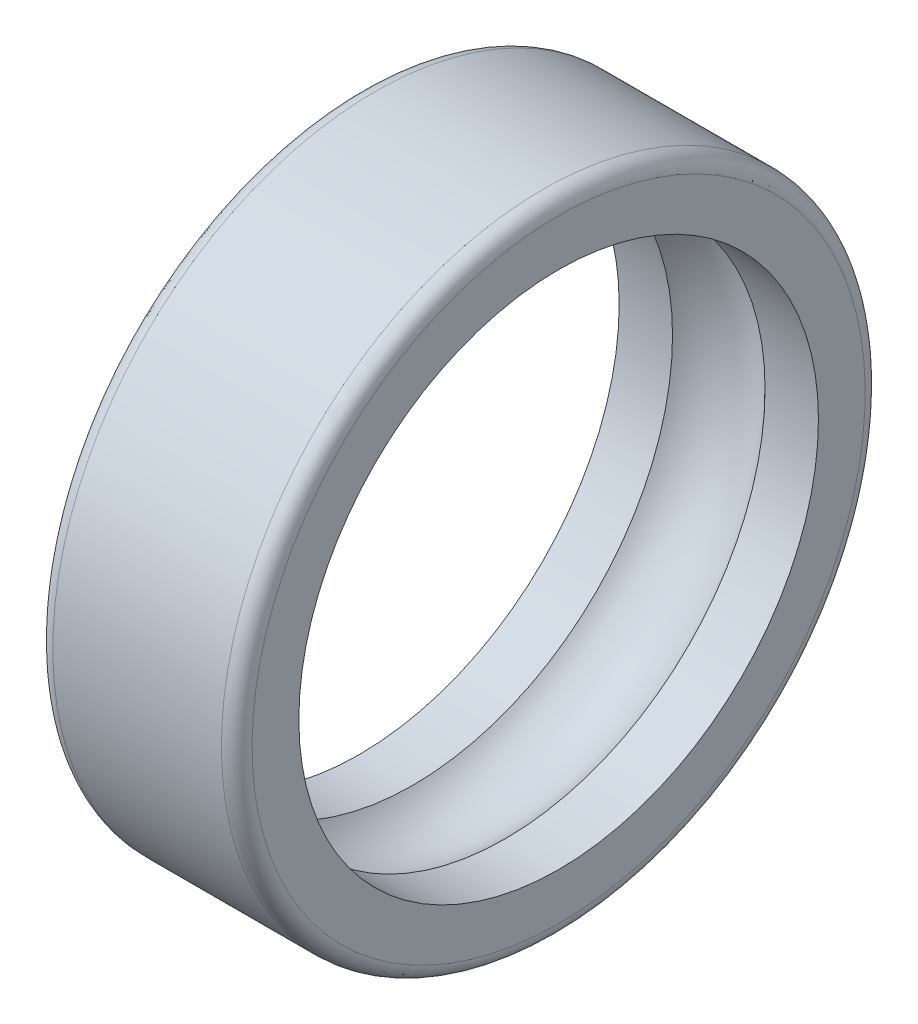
ISO-10303-21;
HEADER;
FILE_DESCRIPTION(('STEP AP214'),'2;1');
FILE_NAME('part.step','',(''),(''),'','','');
FILE_SCHEMA(('AUTOMOTIVE_DESIGN { 1 0 10303 214 1 1 1 1 }'));
ENDSEC;
DATA;
#1=APPLICATION_CONTEXT('core data for automotive mechanical design processes');
#2=APPLICATION_PROTOCOL_DEFINITION('international standard','automotive_design',2000,#1);
#3=PRODUCT_CONTEXT('',#1,'mechanical');
#4=PRODUCT('Part','Part','',(#3));
#5=PRODUCT_RELATED_PRODUCT_CATEGORY('part','',(#4));
#6=PRODUCT_DEFINITION_FORMATION('','',#4);
#7=PRODUCT_DEFINITION_CONTEXT('part definition',#1,'design');
#8=PRODUCT_DEFINITION('design','',#6,#7);
#9=PRODUCT_DEFINITION_SHAPE('','',#8);
#10=(LENGTH_UNIT() NAMED_UNIT(*) SI_UNIT(.MILLI.,.METRE.));
#11=(NAMED_UNIT(*) PLANE_ANGLE_UNIT() SI_UNIT($,.RADIAN.));
#12=(NAMED_UNIT(*) SI_UNIT($,.STERADIAN.) SOLID_ANGLE_UNIT());
#13=UNCERTAINTY_MEASURE_WITH_UNIT(LENGTH_MEASURE(1.E-05),#10,'distance_accuracy_value','');
#14=(GEOMETRIC_REPRESENTATION_CONTEXT(3) GLOBAL_UNCERTAINTY_ASSIGNED_CONTEXT((#13)) GLOBAL_UNIT_ASSIGNED_CONTEXT((#10,
#11,#12)) REPRESENTATION_CONTEXT('',''));
#15=CARTESIAN_POINT('',(0.,0.,0.));
#16=DIRECTION('',(0.,0.,1.));
#17=DIRECTION('',(1.,0.,0.));
#18=AXIS2_PLACEMENT_3D('',#15,#16,#17);
#19=CARTESIAN_POINT('',(1.,0.,0.));
#20=DIRECTION('',(-1.,0.,0.));
#21=DIRECTION('',(0.,-1.,0.));
#22=AXIS2_PLACEMENT_3D('',#19,#20,#21);
#23=TOROIDAL_SURFACE('',#22,20.,1.);
#24=CARTESIAN_POINT('',(0.,0.,0.));
#25=DIRECTION('',(-1.,0.,0.));
#26=DIRECTION('',(0.,-1.,0.));
#27=AXIS2_PLACEMENT_3D('',#24,#25,#26);
#28=CIRCLE('',#27,20.);
#29=CARTESIAN_POINT('',(0.,-20.,0.));
#30=VERTEX_POINT('',#29);
#31=EDGE_CURVE('E10',#30,#30,#28,.T.);
#32=ORIENTED_EDGE('',*,*,#31,.F.);
#33=EDGE_LOOP('',(#32));
#34=FACE_BOUND('',#33,.T.);
#35=CARTESIAN_POINT('',(1.,0.,0.));
#36=DIRECTION('',(-1.,0.,0.));
#37=DIRECTION('',(0.,-1.,0.));
#38=AXIS2_PLACEMENT_3D('',#35,#36,#37);
#39=CIRCLE('',#38,21.);
#40=CARTESIAN_POINT('',(1.,-21.,0.));
#41=VERTEX_POINT('',#40);
#42=EDGE_CURVE('E58',#41,#41,#39,.T.);
#43=ORIENTED_EDGE('',*,*,#42,.T.);
#44=EDGE_LOOP('',(#43));
#45=FACE_BOUND('',#44,.T.);
#46=ADVANCED_FACE('F30',(#34,#45),#23,.T.);
#47=CARTESIAN_POINT('',(0.,16.95,0.));
#48=DIRECTION('',(1.,0.,0.));
#49=DIRECTION('',(0.,1.,0.));
#50=AXIS2_PLACEMENT_3D('',#47,#48,#49);
#51=PLANE('',#50);
#52=CARTESIAN_POINT('',(0.,0.,0.));
#53=DIRECTION('',(-1.,0.,0.));
#54=DIRECTION('',(0.,-1.,0.));
#55=AXIS2_PLACEMENT_3D('',#52,#53,#54);
#56=CIRCLE('',#55,16.95);
#57=CARTESIAN_POINT('',(0.,-16.95,0.));
#58=VERTEX_POINT('',#57);
#59=EDGE_CURVE('E36',#58,#58,#56,.T.);
#60=ORIENTED_EDGE('',*,*,#59,.F.);
#61=EDGE_LOOP('',(#60));
#62=FACE_BOUND('',#61,.T.);
#63=ORIENTED_EDGE('',*,*,#31,.T.);
#64=EDGE_LOOP('',(#63));
#65=FACE_BOUND('',#64,.T.);
#66=ADVANCED_FACE('F95',(#62,#65),#51,.F.);
#67=CARTESIAN_POINT('',(0.,0.,0.));
#68=DIRECTION('',(-1.,0.,0.));
#69=DIRECTION('',(0.,-1.,0.));
#70=AXIS2_PLACEMENT_3D('',#67,#68,#69);
#71=CYLINDRICAL_SURFACE('',#70,16.95);
#72=CARTESIAN_POINT('',(3.48130823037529,0.,0.));
#73=DIRECTION('',(-1.,0.,0.));
#74=DIRECTION('',(0.,-1.,0.));
#75=AXIS2_PLACEMENT_3D('',#72,#73,#74);
#76=CIRCLE('',#75,16.95);
#77=CARTESIAN_POINT('',(3.48130823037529,-16.95,0.));
#78=VERTEX_POINT('',#77);
#79=EDGE_CURVE('E40',#78,#78,#76,.T.);
#80=CARTESIAN_POINT('',(3.48130823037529,-16.95,0.));
#81=CARTESIAN_POINT('',(3.44504460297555,-16.95,0.));
#82=CARTESIAN_POINT('',(3.40878097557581,-16.95,0.));
#83=CARTESIAN_POINT('',(3.33625372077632,-16.95,0.));
#84=CARTESIAN_POINT('',(3.29999009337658,-16.95,0.));
#85=CARTESIAN_POINT('',(3.22746283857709,-16.95,0.));
#86=CARTESIAN_POINT('',(3.19119921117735,-16.95,0.));
#87=CARTESIAN_POINT('',(3.11867195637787,-16.95,0.));
#88=CARTESIAN_POINT('',(3.08240832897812,-16.95,0.));
#89=CARTESIAN_POINT('',(3.00988107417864,-16.95,0.));
#90=CARTESIAN_POINT('',(2.9736174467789,-16.95,0.));
#91=CARTESIAN_POINT('',(2.90109019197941,-16.95,0.));
#92=CARTESIAN_POINT('',(2.86482656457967,-16.95,0.));
#93=CARTESIAN_POINT('',(2.79229930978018,-16.95,0.));
#94=CARTESIAN_POINT('',(2.75603568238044,-16.95,0.));
#95=CARTESIAN_POINT('',(2.68350842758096,-16.95,0.));
#96=CARTESIAN_POINT('',(2.64724480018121,-16.95,0.));
#97=CARTESIAN_POINT('',(2.57471754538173,-16.95,0.));
#98=CARTESIAN_POINT('',(2.53845391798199,-16.95,0.));
#99=CARTESIAN_POINT('',(2.4659266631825,-16.95,0.));
#100=CARTESIAN_POINT('',(2.42966303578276,-16.95,0.));
#101=CARTESIAN_POINT('',(2.35713578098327,-16.95,0.));
#102=CARTESIAN_POINT('',(2.32087215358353,-16.95,0.));
#103=CARTESIAN_POINT('',(2.24834489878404,-16.95,0.));
#104=CARTESIAN_POINT('',(2.2120812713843,-16.95,0.));
#105=CARTESIAN_POINT('',(2.13955401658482,-16.95,0.));
#106=CARTESIAN_POINT('',(2.10329038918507,-16.95,0.));
#107=CARTESIAN_POINT('',(2.03076313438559,-16.95,0.));
#108=CARTESIAN_POINT('',(1.99449950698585,-16.95,0.));
#109=CARTESIAN_POINT('',(1.92197225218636,-16.95,0.));
#110=CARTESIAN_POINT('',(1.88570862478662,-16.95,0.));
#111=CARTESIAN_POINT('',(1.81318136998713,-16.95,0.));
#112=CARTESIAN_POINT('',(1.77691774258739,-16.95,0.));
#113=CARTESIAN_POINT('',(1.70439048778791,-16.95,0.));
#114=CARTESIAN_POINT('',(1.66812686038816,-16.95,0.));
#115=CARTESIAN_POINT('',(1.59559960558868,-16.95,0.));
#116=CARTESIAN_POINT('',(1.55933597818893,-16.95,0.));
#117=CARTESIAN_POINT('',(1.48680872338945,-16.95,0.));
#118=CARTESIAN_POINT('',(1.45054509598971,-16.95,0.));
#119=CARTESIAN_POINT('',(1.37801784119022,-16.95,0.));
#120=CARTESIAN_POINT('',(1.34175421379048,-16.95,0.));
#121=CARTESIAN_POINT('',(1.26922695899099,-16.95,0.));
#122=CARTESIAN_POINT('',(1.23296333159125,-16.95,0.));
#123=CARTESIAN_POINT('',(1.16043607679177,-16.95,0.));
#124=CARTESIAN_POINT('',(1.12417244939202,-16.95,0.));
#125=CARTESIAN_POINT('',(1.05164519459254,-16.95,0.));
#126=CARTESIAN_POINT('',(1.0153815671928,-16.95,0.));
#127=CARTESIAN_POINT('',(0.94285431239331,-16.95,0.));
#128=CARTESIAN_POINT('',(0.906590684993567,-16.95,0.));
#129=CARTESIAN_POINT('',(0.834063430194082,-16.95,0.));
#130=CARTESIAN_POINT('',(0.797799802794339,-16.95,0.));
#131=CARTESIAN_POINT('',(0.725272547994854,-16.95,0.));
#132=CARTESIAN_POINT('',(0.689008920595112,-16.95,0.));
#133=CARTESIAN_POINT('',(0.616481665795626,-16.95,0.));
#134=CARTESIAN_POINT('',(0.580218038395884,-16.95,0.));
#135=CARTESIAN_POINT('',(0.507690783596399,-16.95,0.));
#136=CARTESIAN_POINT('',(0.471427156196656,-16.95,0.));
#137=CARTESIAN_POINT('',(0.398899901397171,-16.95,0.));
#138=CARTESIAN_POINT('',(0.362636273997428,-16.95,0.));
#139=CARTESIAN_POINT('',(0.290109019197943,-16.95,0.));
#140=CARTESIAN_POINT('',(0.2538453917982,-16.95,0.));
#141=CARTESIAN_POINT('',(0.181318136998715,-16.95,0.));
#142=CARTESIAN_POINT('',(0.145054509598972,-16.95,0.));
#143=CARTESIAN_POINT('',(0.0725272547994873,-16.95,0.));
#144=CARTESIAN_POINT('',(0.0362636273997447,-16.95,0.));
#145=CARTESIAN_POINT('',(0.,-16.95,0.));
#146=B_SPLINE_CURVE_WITH_KNOTS('',3,(#80,#81,#82,#83,#84,#85,#86,#87,#88,#89,#90,#91,#92,#93,
#94,#95,#96,#97,#98,#99,#100,#101,#102,#103,#104,#105,#106,#107,#108,#109,#110,#111,#112,#113,
#114,#115,#116,#117,#118,#119,#120,#121,#122,#123,#124,#125,#126,#127,#128,#129,#130,#131,#132,
#133,#134,#135,#136,#137,#138,#139,#140,#141,#142,#143,#144,#145),.UNSPECIFIED.,.F.,.F.,(4,2,2,
2,2,2,2,2,2,2,2,2,2,2,2,2,2,2,2,2,2,2,2,2,2,2,2,2,2,2,2,2,4),(0.,0.108790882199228,
0.217581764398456,0.326372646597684,0.435163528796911,0.543954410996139,0.652745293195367,
0.761536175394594,0.870327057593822,0.97911793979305,1.08790882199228,1.19669970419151,
1.30549058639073,1.41428146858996,1.52307235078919,1.63186323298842,1.74065411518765,
1.84944499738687,1.9582358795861,2.06702676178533,2.17581764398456,2.28460852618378,
2.39339940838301,2.50219029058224,2.61098117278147,2.7197720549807,2.82856293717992,
2.93735381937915,3.04614470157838,3.15493558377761,3.26372646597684,3.37251734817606,
3.48130823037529),.UNSPECIFIED.);
#147=EDGE_CURVE('BSEAM90',#78,#58,#146,.T.);
#148=ORIENTED_EDGE('',*,*,#79,.F.);
#149=ORIENTED_EDGE('',*,*,#59,.T.);
#150=ORIENTED_EDGE('',*,*,#147,.T.);
#151=ORIENTED_EDGE('',*,*,#147,.F.);
#152=EDGE_LOOP('',(#148,#150,#149,#151));
#153=FACE_BOUND('',#152,.T.);
#154=ADVANCED_FACE('F90',(#153),#71,.F.);
#155=CARTESIAN_POINT('',(6.50000000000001,0.,0.));
#156=DIRECTION('',(-1.,0.,0.));
#157=DIRECTION('',(0.,-1.,0.));
#158=AXIS2_PLACEMENT_3D('',#155,#156,#157);
#159=TOROIDAL_SURFACE('',#158,14.25,4.05);
#160=CARTESIAN_POINT('',(9.51869176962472,0.,0.));
#161=DIRECTION('',(-1.,0.,0.));
#162=DIRECTION('',(0.,-1.,0.));
#163=AXIS2_PLACEMENT_3D('',#160,#161,#162);
#164=CIRCLE('',#163,16.95);
#165=CARTESIAN_POINT('',(9.51869176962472,-16.95,0.));
#166=VERTEX_POINT('',#165);
#167=EDGE_CURVE('E44',#166,#166,#164,.T.);
#168=ORIENTED_EDGE('',*,*,#167,.F.);
#169=EDGE_LOOP('',(#168));
#170=FACE_BOUND('',#169,.T.);
#171=ORIENTED_EDGE('',*,*,#79,.T.);
#172=EDGE_LOOP('',(#171));
#173=FACE_BOUND('',#172,.T.);
#174=ADVANCED_FACE('F84',(#170,#173),#159,.F.);
#175=CARTESIAN_POINT('',(0.,0.,0.));
#176=DIRECTION('',(-1.,0.,0.));
#177=DIRECTION('',(0.,-1.,0.));
#178=AXIS2_PLACEMENT_3D('',#175,#176,#177);
#179=CYLINDRICAL_SURFACE('',#178,16.95);
#180=CARTESIAN_POINT('',(13.,0.,0.));
#181=DIRECTION('',(-1.,0.,0.));
#182=DIRECTION('',(0.,-1.,0.));
#183=AXIS2_PLACEMENT_3D('',#180,#181,#182);
#184=CIRCLE('',#183,16.95);
#185=CARTESIAN_POINT('',(13.,-16.95,0.));
#186=VERTEX_POINT('',#185);
#187=EDGE_CURVE('E49',#186,#186,#184,.T.);
#188=CARTESIAN_POINT('',(13.,-16.95,0.));
#189=CARTESIAN_POINT('',(12.9637363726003,-16.95,0.));
#190=CARTESIAN_POINT('',(12.9274727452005,-16.95,0.));
#191=CARTESIAN_POINT('',(12.854945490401,-16.95,0.));
#192=CARTESIAN_POINT('',(12.8186818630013,-16.95,0.));
#193=CARTESIAN_POINT('',(12.7461546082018,-16.95,0.));
#194=CARTESIAN_POINT('',(12.7098909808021,-16.95,0.));
#195=CARTESIAN_POINT('',(12.6373637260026,-16.95,0.));
#196=CARTESIAN_POINT('',(12.6011000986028,-16.95,0.));
#197=CARTESIAN_POINT('',(12.5285728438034,-16.95,0.));
#198=CARTESIAN_POINT('',(12.4923092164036,-16.95,0.));
#199=CARTESIAN_POINT('',(12.4197819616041,-16.95,0.));
#200=CARTESIAN_POINT('',(12.3835183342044,-16.95,0.));
#201=CARTESIAN_POINT('',(12.3109910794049,-16.95,0.));
#202=CARTESIAN_POINT('',(12.2747274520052,-16.95,0.));
#203=CARTESIAN_POINT('',(12.2022001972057,-16.95,0.));
#204=CARTESIAN_POINT('',(12.1659365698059,-16.95,0.));
#205=CARTESIAN_POINT('',(12.0934093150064,-16.95,0.));
#206=CARTESIAN_POINT('',(12.0571456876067,-16.95,0.));
#207=CARTESIAN_POINT('',(11.9846184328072,-16.95,0.));
#208=CARTESIAN_POINT('',(11.9483548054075,-16.95,0.));
#209=CARTESIAN_POINT('',(11.875827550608,-16.95,0.));
#210=CARTESIAN_POINT('',(11.8395639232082,-16.95,0.));
#211=CARTESIAN_POINT('',(11.7670366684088,-16.95,0.));
#212=CARTESIAN_POINT('',(11.730773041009,-16.95,0.));
#213=CARTESIAN_POINT('',(11.6582457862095,-16.95,0.));
#214=CARTESIAN_POINT('',(11.6219821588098,-16.95,0.));
#215=CARTESIAN_POINT('',(11.5494549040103,-16.95,0.));
#216=CARTESIAN_POINT('',(11.5131912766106,-16.95,0.));
#217=CARTESIAN_POINT('',(11.4406640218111,-16.95,0.));
#218=CARTESIAN_POINT('',(11.4044003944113,-16.95,0.));
#219=CARTESIAN_POINT('',(11.3318731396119,-16.95,0.));
#220=CARTESIAN_POINT('',(11.2956095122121,-16.95,0.));
#221=CARTESIAN_POINT('',(11.2230822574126,-16.95,0.));
#222=CARTESIAN_POINT('',(11.1868186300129,-16.95,0.));
#223=CARTESIAN_POINT('',(11.1142913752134,-16.95,0.));
#224=CARTESIAN_POINT('',(11.0780277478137,-16.95,0.));
#225=CARTESIAN_POINT('',(11.0055004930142,-16.95,0.));
#226=CARTESIAN_POINT('',(10.9692368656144,-16.95,0.));
#227=CARTESIAN_POINT('',(10.8967096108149,-16.95,0.));
#228=CARTESIAN_POINT('',(10.8604459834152,-16.95,0.));
#229=CARTESIAN_POINT('',(10.7879187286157,-16.95,0.));
#230=CARTESIAN_POINT('',(10.751655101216,-16.95,0.));
#231=CARTESIAN_POINT('',(10.6791278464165,-16.95,0.));
#232=CARTESIAN_POINT('',(10.6428642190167,-16.95,0.));
#233=CARTESIAN_POINT('',(10.5703369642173,-16.95,0.));
#234=CARTESIAN_POINT('',(10.5340733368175,-16.95,0.));
#235=CARTESIAN_POINT('',(10.461546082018,-16.95,0.));
#236=CARTESIAN_POINT('',(10.4252824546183,-16.95,0.));
#237=CARTESIAN_POINT('',(10.3527551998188,-16.95,0.));
#238=CARTESIAN_POINT('',(10.3164915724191,-16.95,0.));
#239=CARTESIAN_POINT('',(10.2439643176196,-16.95,0.));
#240=CARTESIAN_POINT('',(10.2077006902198,-16.95,0.));
#241=CARTESIAN_POINT('',(10.1351734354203,-16.95,0.));
#242=CARTESIAN_POINT('',(10.0989098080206,-16.95,0.));
#243=CARTESIAN_POINT('',(10.0263825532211,-16.95,0.));
#244=CARTESIAN_POINT('',(9.99011892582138,-16.95,0.));
#245=CARTESIAN_POINT('',(9.91759167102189,-16.95,0.));
#246=CARTESIAN_POINT('',(9.88132804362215,-16.95,0.));
#247=CARTESIAN_POINT('',(9.80880078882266,-16.95,0.));
#248=CARTESIAN_POINT('',(9.77253716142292,-16.95,0.));
#249=CARTESIAN_POINT('',(9.70000990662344,-16.95,0.));
#250=CARTESIAN_POINT('',(9.66374627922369,-16.95,0.));
#251=CARTESIAN_POINT('',(9.59121902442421,-16.95,0.));
#252=CARTESIAN_POINT('',(9.55495539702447,-16.95,0.));
#253=CARTESIAN_POINT('',(9.51869176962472,-16.95,0.));
#254=B_SPLINE_CURVE_WITH_KNOTS('',3,(#188,#189,#190,#191,#192,#193,#194,#195,#196,#197,#198,
#199,#200,#201,#202,#203,#204,#205,#206,#207,#208,#209,#210,#211,#212,#213,#214,#215,#216,#217,
#218,#219,#220,#221,#222,#223,#224,#225,#226,#227,#228,#229,#230,#231,#232,#233,#234,#235,#236,
#237,#238,#239,#240,#241,#242,#243,#244,#245,#246,#247,#248,#249,#250,#251,#252,#253),
.UNSPECIFIED.,.F.,.F.,(4,2,2,2,2,2,2,2,2,2,2,2,2,2,2,2,2,2,2,2,2,2,2,2,2,2,2,2,2,2,2,2,4),(0.,
0.108790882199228,0.217581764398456,0.326372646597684,0.435163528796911,0.543954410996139,
0.652745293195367,0.761536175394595,0.870327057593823,0.979117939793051,1.08790882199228,
1.19669970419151,1.30549058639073,1.41428146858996,1.52307235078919,1.63186323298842,
1.74065411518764,1.84944499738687,1.9582358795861,2.06702676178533,2.17581764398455,
2.28460852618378,2.39339940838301,2.50219029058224,2.61098117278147,2.71977205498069,
2.82856293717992,2.93735381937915,3.04614470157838,3.15493558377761,3.26372646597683,
3.37251734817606,3.48130823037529),.UNSPECIFIED.);
#255=EDGE_CURVE('BSEAM78',#186,#166,#254,.T.);
#256=ORIENTED_EDGE('',*,*,#187,.F.);
#257=ORIENTED_EDGE('',*,*,#167,.T.);
#258=ORIENTED_EDGE('',*,*,#255,.T.);
#259=ORIENTED_EDGE('',*,*,#255,.F.);
#260=EDGE_LOOP('',(#256,#258,#257,#259));
#261=FACE_BOUND('',#260,.T.);
#262=ADVANCED_FACE('F78',(#261),#179,.F.);
#263=CARTESIAN_POINT('',(13.,20.,0.));
#264=DIRECTION('',(-1.,0.,0.));
#265=DIRECTION('',(0.,-1.,0.));
#266=AXIS2_PLACEMENT_3D('',#263,#264,#265);
#267=PLANE('',#266);
#268=CARTESIAN_POINT('',(13.,0.,0.));
#269=DIRECTION('',(-1.,0.,0.));
#270=DIRECTION('',(0.,-1.,0.));
#271=AXIS2_PLACEMENT_3D('',#268,#269,#270);
#272=CIRCLE('',#271,20.);
#273=CARTESIAN_POINT('',(13.,-20.,0.));
#274=VERTEX_POINT('',#273);
#275=EDGE_CURVE('E52',#274,#274,#272,.T.);
#276=ORIENTED_EDGE('',*,*,#275,.F.);
#277=EDGE_LOOP('',(#276));
#278=FACE_BOUND('',#277,.T.);
#279=ORIENTED_EDGE('',*,*,#187,.T.);
#280=EDGE_LOOP('',(#279));
#281=FACE_BOUND('',#280,.T.);
#282=ADVANCED_FACE('F72',(#278,#281),#267,.F.);
#283=CARTESIAN_POINT('',(12.,0.,0.));
#284=DIRECTION('',(-1.,0.,0.));
#285=DIRECTION('',(0.,-1.,0.));
#286=AXIS2_PLACEMENT_3D('',#283,#284,#285);
#287=TOROIDAL_SURFACE('',#286,20.,1.);
#288=CARTESIAN_POINT('',(12.,0.,0.));
#289=DIRECTION('',(-1.,0.,0.));
#290=DIRECTION('',(0.,-1.,0.));
#291=AXIS2_PLACEMENT_3D('',#288,#289,#290);
#292=CIRCLE('',#291,21.);
#293=CARTESIAN_POINT('',(12.,-21.,0.));
#294=VERTEX_POINT('',#293);
#295=EDGE_CURVE('E55',#294,#294,#292,.T.);
#296=ORIENTED_EDGE('',*,*,#295,.F.);
#297=EDGE_LOOP('',(#296));
#298=FACE_BOUND('',#297,.T.);
#299=ORIENTED_EDGE('',*,*,#275,.T.);
#300=EDGE_LOOP('',(#299));
#301=FACE_BOUND('',#300,.T.);
#302=ADVANCED_FACE('F66',(#298,#301),#287,.T.);
#303=CARTESIAN_POINT('',(0.,0.,0.));
#304=DIRECTION('',(-1.,0.,0.));
#305=DIRECTION('',(0.,-1.,0.));
#306=AXIS2_PLACEMENT_3D('',#303,#304,#305);
#307=CYLINDRICAL_SURFACE('',#306,21.);
#308=CARTESIAN_POINT('',(1.,-21.,0.));
#309=CARTESIAN_POINT('',(1.11458333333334,-21.,0.));
#310=CARTESIAN_POINT('',(1.22916666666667,-21.,0.));
#311=CARTESIAN_POINT('',(1.45833333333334,-21.,0.));
#312=CARTESIAN_POINT('',(1.57291666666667,-21.,0.));
#313=CARTESIAN_POINT('',(1.80208333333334,-21.,0.));
#314=CARTESIAN_POINT('',(1.91666666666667,-21.,0.));
#315=CARTESIAN_POINT('',(2.14583333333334,-21.,0.));
#316=CARTESIAN_POINT('',(2.26041666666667,-21.,0.));
#317=CARTESIAN_POINT('',(2.48958333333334,-21.,0.));
#318=CARTESIAN_POINT('',(2.60416666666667,-21.,0.));
#319=CARTESIAN_POINT('',(2.83333333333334,-21.,0.));
#320=CARTESIAN_POINT('',(2.94791666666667,-21.,0.));
#321=CARTESIAN_POINT('',(3.17708333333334,-21.,0.));
#322=CARTESIAN_POINT('',(3.29166666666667,-21.,0.));
#323=CARTESIAN_POINT('',(3.52083333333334,-21.,0.));
#324=CARTESIAN_POINT('',(3.63541666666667,-21.,0.));
#325=CARTESIAN_POINT('',(3.86458333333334,-21.,0.));
#326=CARTESIAN_POINT('',(3.97916666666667,-21.,0.));
#327=CARTESIAN_POINT('',(4.20833333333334,-21.,0.));
#328=CARTESIAN_POINT('',(4.32291666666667,-21.,0.));
#329=CARTESIAN_POINT('',(4.55208333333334,-21.,0.));
#330=CARTESIAN_POINT('',(4.66666666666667,-21.,0.));
#331=CARTESIAN_POINT('',(4.89583333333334,-21.,0.));
#332=CARTESIAN_POINT('',(5.01041666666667,-21.,0.));
#333=CARTESIAN_POINT('',(5.23958333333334,-21.,0.));
#334=CARTESIAN_POINT('',(5.35416666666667,-21.,0.));
#335=CARTESIAN_POINT('',(5.58333333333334,-21.,0.));
#336=CARTESIAN_POINT('',(5.69791666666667,-21.,0.));
#337=CARTESIAN_POINT('',(5.92708333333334,-21.,0.));
#338=CARTESIAN_POINT('',(6.04166666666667,-21.,0.));
#339=CARTESIAN_POINT('',(6.27083333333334,-21.,0.));
#340=CARTESIAN_POINT('',(6.38541666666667,-21.,0.));
#341=CARTESIAN_POINT('',(6.61458333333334,-21.,0.));
#342=CARTESIAN_POINT('',(6.72916666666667,-21.,0.));
#343=CARTESIAN_POINT('',(6.95833333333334,-21.,0.));
#344=CARTESIAN_POINT('',(7.07291666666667,-21.,0.));
#345=CARTESIAN_POINT('',(7.30208333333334,-21.,0.));
#346=CARTESIAN_POINT('',(7.41666666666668,-21.,0.));
#347=CARTESIAN_POINT('',(7.64583333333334,-21.,0.));
#348=CARTESIAN_POINT('',(7.76041666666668,-21.,0.));
#349=CARTESIAN_POINT('',(7.98958333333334,-21.,0.));
#350=CARTESIAN_POINT('',(8.10416666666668,-21.,0.));
#351=CARTESIAN_POINT('',(8.33333333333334,-21.,0.));
#352=CARTESIAN_POINT('',(8.44791666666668,-21.,0.));
#353=CARTESIAN_POINT('',(8.67708333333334,-21.,0.));
#354=CARTESIAN_POINT('',(8.79166666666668,-21.,0.));
#355=CARTESIAN_POINT('',(9.02083333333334,-21.,0.));
#356=CARTESIAN_POINT('',(9.13541666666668,-21.,0.));
#357=CARTESIAN_POINT('',(9.36458333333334,-21.,0.));
#358=CARTESIAN_POINT('',(9.47916666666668,-21.,0.));
#359=CARTESIAN_POINT('',(9.70833333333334,-21.,0.));
#360=CARTESIAN_POINT('',(9.82291666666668,-21.,0.));
#361=CARTESIAN_POINT('',(10.0520833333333,-21.,0.));
#362=CARTESIAN_POINT('',(10.1666666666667,-21.,0.));
#363=CARTESIAN_POINT('',(10.3958333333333,-21.,0.));
#364=CARTESIAN_POINT('',(10.5104166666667,-21.,0.));
#365=CARTESIAN_POINT('',(10.7395833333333,-21.,0.));
#366=CARTESIAN_POINT('',(10.8541666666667,-21.,0.));
#367=CARTESIAN_POINT('',(11.0833333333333,-21.,0.));
#368=CARTESIAN_POINT('',(11.1979166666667,-21.,0.));
#369=CARTESIAN_POINT('',(11.4270833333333,-21.,0.));
#370=CARTESIAN_POINT('',(11.5416666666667,-21.,0.));
#371=CARTESIAN_POINT('',(11.7708333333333,-21.,0.));
#372=CARTESIAN_POINT('',(11.8854166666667,-21.,0.));
#373=CARTESIAN_POINT('',(12.,-21.,0.));
#374=B_SPLINE_CURVE_WITH_KNOTS('',3,(#308,#309,#310,#311,#312,#313,#314,#315,#316,#317,#318,
#319,#320,#321,#322,#323,#324,#325,#326,#327,#328,#329,#330,#331,#332,#333,#334,#335,#336,#337,
#338,#339,#340,#341,#342,#343,#344,#345,#346,#347,#348,#349,#350,#351,#352,#353,#354,#355,#356,
#357,#358,#359,#360,#361,#362,#363,#364,#365,#366,#367,#368,#369,#370,#371,#372,#373),
.UNSPECIFIED.,.F.,.F.,(4,2,2,2,2,2,2,2,2,2,2,2,2,2,2,2,2,2,2,2,2,2,2,2,2,2,2,2,2,2,2,2,4),(0.,
0.34375,0.687500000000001,1.03125,1.375,1.71875,2.0625,2.40625,2.75,3.09375,3.4375,3.78125,
4.125,4.46875,4.81250000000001,5.15625,5.50000000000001,5.84375000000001,6.18750000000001,
6.53125000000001,6.87500000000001,7.21875000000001,7.56250000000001,7.90625000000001,
8.25000000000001,8.59375000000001,8.93750000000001,9.28125000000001,9.62500000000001,
9.96875000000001,10.3125,10.65625,11.),.UNSPECIFIED.);
#375=EDGE_CURVE('BSEAM63',#41,#294,#374,.T.);
#376=ORIENTED_EDGE('',*,*,#42,.F.);
#377=ORIENTED_EDGE('',*,*,#295,.T.);
#378=ORIENTED_EDGE('',*,*,#375,.T.);
#379=ORIENTED_EDGE('',*,*,#375,.F.);
#380=EDGE_LOOP('',(#376,#378,#377,#379));
#381=FACE_BOUND('',#380,.T.);
#382=ADVANCED_FACE('F63',(#381),#307,.T.);
#383=CLOSED_SHELL('',(#46,#66,#154,#174,#262,#282,#302,#382));
#384=MANIFOLD_SOLID_BREP('B2',#383);
#385=ADVANCED_BREP_SHAPE_REPRESENTATION('',(#18,#384),#14);
#386=SHAPE_DEFINITION_REPRESENTATION(#9,#385);
ENDSEC;
END-ISO-10303-21;
